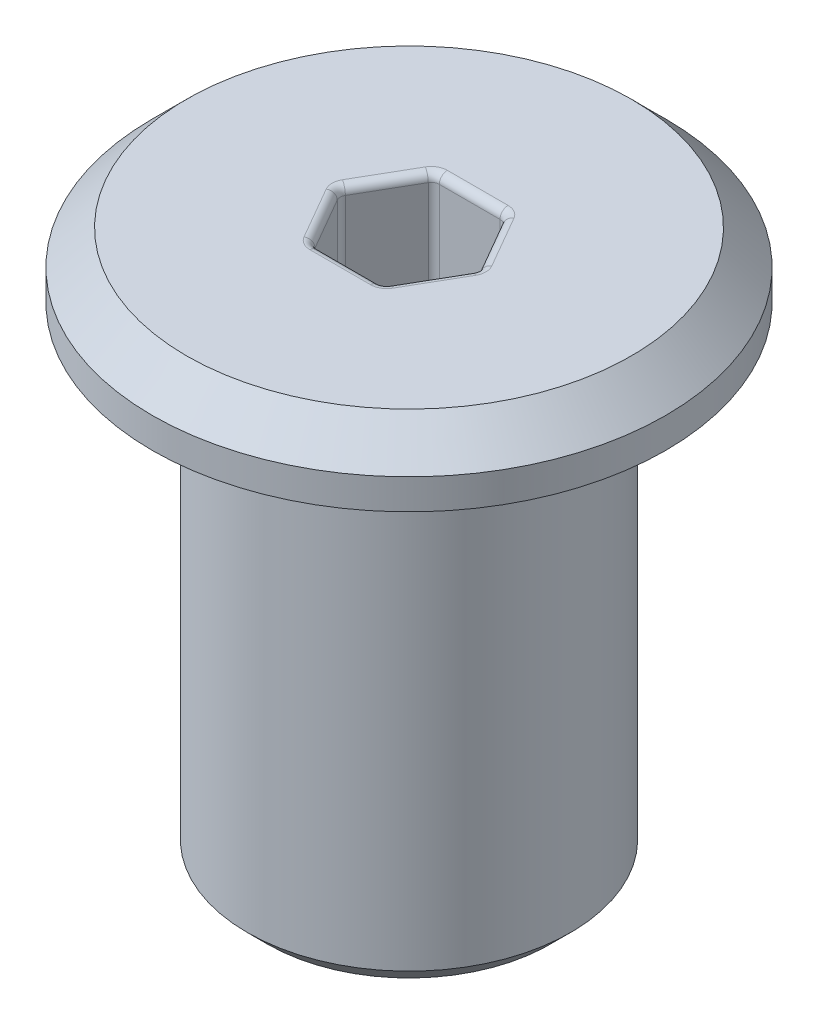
ISO-10303-21;
HEADER;
FILE_DESCRIPTION(('STEP AP214'),'2;1');
FILE_NAME('part.step','',(''),(''),'','','');
FILE_SCHEMA(('AUTOMOTIVE_DESIGN { 1 0 10303 214 1 1 1 1 }'));
ENDSEC;
DATA;
#1=APPLICATION_CONTEXT('core data for automotive mechanical design processes');
#2=APPLICATION_PROTOCOL_DEFINITION('international standard','automotive_design',2000,#1);
#3=PRODUCT_CONTEXT('',#1,'mechanical');
#4=PRODUCT('Part','Part','',(#3));
#5=PRODUCT_RELATED_PRODUCT_CATEGORY('part','',(#4));
#6=PRODUCT_DEFINITION_FORMATION('','',#4);
#7=PRODUCT_DEFINITION_CONTEXT('part definition',#1,'design');
#8=PRODUCT_DEFINITION('design','',#6,#7);
#9=PRODUCT_DEFINITION_SHAPE('','',#8);
#10=(LENGTH_UNIT() NAMED_UNIT(*) SI_UNIT(.MILLI.,.METRE.));
#11=(NAMED_UNIT(*) PLANE_ANGLE_UNIT() SI_UNIT($,.RADIAN.));
#12=(NAMED_UNIT(*) SI_UNIT($,.STERADIAN.) SOLID_ANGLE_UNIT());
#13=UNCERTAINTY_MEASURE_WITH_UNIT(LENGTH_MEASURE(1.E-05),#10,'distance_accuracy_value','');
#14=(GEOMETRIC_REPRESENTATION_CONTEXT(3) GLOBAL_UNCERTAINTY_ASSIGNED_CONTEXT((#13)) GLOBAL_UNIT_ASSIGNED_CONTEXT((#10,
#11,#12)) REPRESENTATION_CONTEXT('',''));
#15=CARTESIAN_POINT('',(0.,0.,0.));
#16=DIRECTION('',(0.,0.,1.));
#17=DIRECTION('',(1.,0.,0.));
#18=AXIS2_PLACEMENT_3D('',#15,#16,#17);
#19=CARTESIAN_POINT('',(0.,4.5,0.));
#20=DIRECTION('',(0.,1.,0.));
#21=DIRECTION('',(0.,0.,1.));
#22=AXIS2_PLACEMENT_3D('',#19,#20,#21);
#23=CYLINDRICAL_SURFACE('',#22,6.35);
#24=CARTESIAN_POINT('',(0.,0.,0.));
#25=DIRECTION('',(0.,1.,0.));
#26=DIRECTION('',(0.,0.,1.));
#27=AXIS2_PLACEMENT_3D('',#24,#25,#26);
#28=CIRCLE('',#27,6.35);
#29=CARTESIAN_POINT('',(0.,0.,6.35));
#30=VERTEX_POINT('',#29);
#31=EDGE_CURVE('E242',#30,#30,#28,.T.);
#32=ORIENTED_EDGE('',*,*,#31,.T.);
#33=EDGE_LOOP('',(#32));
#34=FACE_BOUND('',#33,.T.);
#35=CARTESIAN_POINT('',(0.,0.75,0.));
#36=DIRECTION('',(0.,1.,0.));
#37=DIRECTION('',(0.,0.,1.));
#38=AXIS2_PLACEMENT_3D('',#35,#36,#37);
#39=CIRCLE('',#38,6.35);
#40=CARTESIAN_POINT('',(0.,0.75,6.35));
#41=VERTEX_POINT('',#40);
#42=EDGE_CURVE('E189',#41,#41,#39,.T.);
#43=ORIENTED_EDGE('',*,*,#42,.F.);
#44=EDGE_LOOP('',(#43));
#45=FACE_BOUND('',#44,.T.);
#46=ADVANCED_FACE('F29',(#34,#45),#23,.T.);
#47=CARTESIAN_POINT('',(0.,1.6,0.));
#48=DIRECTION('',(0.,-1.,0.));
#49=DIRECTION('',(0.,0.,-1.));
#50=AXIS2_PLACEMENT_3D('',#47,#48,#49);
#51=CONICAL_SURFACE('',#50,5.5,0.785398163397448);
#52=ORIENTED_EDGE('',*,*,#42,.T.);
#53=EDGE_LOOP('',(#52));
#54=FACE_BOUND('',#53,.T.);
#55=CARTESIAN_POINT('',(0.,1.6,0.));
#56=DIRECTION('',(0.,1.,0.));
#57=DIRECTION('',(0.,0.,1.));
#58=AXIS2_PLACEMENT_3D('',#55,#56,#57);
#59=CIRCLE('',#58,5.5);
#60=CARTESIAN_POINT('',(0.,1.6,5.5));
#61=VERTEX_POINT('',#60);
#62=EDGE_CURVE('E254',#61,#61,#59,.T.);
#63=ORIENTED_EDGE('',*,*,#62,.F.);
#64=EDGE_LOOP('',(#63));
#65=FACE_BOUND('',#64,.T.);
#66=ADVANCED_FACE('F509',(#54,#65),#51,.T.);
#67=CARTESIAN_POINT('',(-5.5,1.6,0.));
#68=DIRECTION('',(0.,1.,0.));
#69=DIRECTION('',(0.,0.,1.));
#70=AXIS2_PLACEMENT_3D('',#67,#68,#69);
#71=PLANE('',#70);
#72=CARTESIAN_POINT('',(0.750555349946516,1.6,-1.3));
#73=DIRECTION('',(0.,1.,0.));
#74=DIRECTION('',(0.,0.,1.));
#75=AXIS2_PLACEMENT_3D('',#72,#73,#74);
#76=CIRCLE('',#75,0.4);
#77=CARTESIAN_POINT('',(1.09696551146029,1.6,-1.5));
#78=VERTEX_POINT('',#77);
#79=CARTESIAN_POINT('',(0.750555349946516,1.6,-1.7));
#80=VERTEX_POINT('',#79);
#81=EDGE_CURVE('E302',#78,#80,#76,.T.);
#82=ORIENTED_EDGE('',*,*,#81,.F.);
#83=DIRECTION('',(-0.499999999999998,0.,-0.86602540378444));
#84=VECTOR('',#83,1.);
#85=CARTESIAN_POINT('',(1.90525588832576,1.6,-0.0999999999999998));
#86=LINE('',#85,#84);
#87=CARTESIAN_POINT('',(1.8475208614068,1.6,-0.199999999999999));
#88=VERTEX_POINT('',#87);
#89=EDGE_CURVE('E313',#78,#88,#86,.F.);
#90=ORIENTED_EDGE('',*,*,#89,.T.);
#91=CARTESIAN_POINT('',(1.50111069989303,1.6,0.));
#92=DIRECTION('',(0.,1.,0.));
#93=DIRECTION('',(0.,0.,1.));
#94=AXIS2_PLACEMENT_3D('',#91,#92,#93);
#95=CIRCLE('',#94,0.4);
#96=CARTESIAN_POINT('',(1.8475208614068,1.6,0.199999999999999));
#97=VERTEX_POINT('',#96);
#98=EDGE_CURVE('E310',#97,#88,#95,.T.);
#99=ORIENTED_EDGE('',*,*,#98,.F.);
#100=DIRECTION('',(0.499999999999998,0.,-0.86602540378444));
#101=VECTOR('',#100,1.);
#102=CARTESIAN_POINT('',(1.03923048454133,1.6,1.6));
#103=LINE('',#102,#101);
#104=CARTESIAN_POINT('',(1.09696551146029,1.6,1.5));
#105=VERTEX_POINT('',#104);
#106=EDGE_CURVE('E308',#97,#105,#103,.F.);
#107=ORIENTED_EDGE('',*,*,#106,.T.);
#108=CARTESIAN_POINT('',(0.750555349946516,1.6,1.3));
#109=DIRECTION('',(0.,1.,0.));
#110=DIRECTION('',(0.,0.,1.));
#111=AXIS2_PLACEMENT_3D('',#108,#109,#110);
#112=CIRCLE('',#111,0.4);
#113=CARTESIAN_POINT('',(0.750555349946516,1.6,1.7));
#114=VERTEX_POINT('',#113);
#115=EDGE_CURVE('E305',#114,#105,#112,.T.);
#116=ORIENTED_EDGE('',*,*,#115,.F.);
#117=DIRECTION('',(1.,0.,0.));
#118=VECTOR('',#117,1.);
#119=CARTESIAN_POINT('',(-0.866025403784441,1.6,1.7));
#120=LINE('',#119,#118);
#121=CARTESIAN_POINT('',(-0.750555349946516,1.6,1.7));
#122=VERTEX_POINT('',#121);
#123=EDGE_CURVE('E300',#114,#122,#120,.F.);
#124=ORIENTED_EDGE('',*,*,#123,.T.);
#125=CARTESIAN_POINT('',(-0.750555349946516,1.6,1.3));
#126=DIRECTION('',(0.,1.,0.));
#127=DIRECTION('',(0.,0.,1.));
#128=AXIS2_PLACEMENT_3D('',#125,#126,#127);
#129=CIRCLE('',#128,0.4);
#130=CARTESIAN_POINT('',(-1.09696551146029,1.6,1.5));
#131=VERTEX_POINT('',#130);
#132=EDGE_CURVE('E297',#131,#122,#129,.T.);
#133=ORIENTED_EDGE('',*,*,#132,.F.);
#134=DIRECTION('',(0.499999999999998,0.,0.86602540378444));
#135=VECTOR('',#134,1.);
#136=CARTESIAN_POINT('',(-1.90525588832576,1.6,0.0999999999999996));
#137=LINE('',#136,#135);
#138=CARTESIAN_POINT('',(-1.8475208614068,1.6,0.199999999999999));
#139=VERTEX_POINT('',#138);
#140=EDGE_CURVE('E292',#131,#139,#137,.F.);
#141=ORIENTED_EDGE('',*,*,#140,.T.);
#142=CARTESIAN_POINT('',(-1.50111069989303,1.6,0.));
#143=DIRECTION('',(0.,1.,0.));
#144=DIRECTION('',(0.,0.,1.));
#145=AXIS2_PLACEMENT_3D('',#142,#143,#144);
#146=CIRCLE('',#145,0.4);
#147=CARTESIAN_POINT('',(-1.8475208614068,1.6,-0.199999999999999));
#148=VERTEX_POINT('',#147);
#149=EDGE_CURVE('E289',#148,#139,#146,.T.);
#150=ORIENTED_EDGE('',*,*,#149,.F.);
#151=DIRECTION('',(-0.499999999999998,0.,0.86602540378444));
#152=VECTOR('',#151,1.);
#153=CARTESIAN_POINT('',(-1.03923048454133,1.6,-1.6));
#154=LINE('',#153,#152);
#155=CARTESIAN_POINT('',(-1.09696551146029,1.6,-1.5));
#156=VERTEX_POINT('',#155);
#157=EDGE_CURVE('E287',#148,#156,#154,.F.);
#158=ORIENTED_EDGE('',*,*,#157,.T.);
#159=CARTESIAN_POINT('',(-0.750555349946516,1.6,-1.3));
#160=DIRECTION('',(0.,1.,0.));
#161=DIRECTION('',(0.,0.,1.));
#162=AXIS2_PLACEMENT_3D('',#159,#160,#161);
#163=CIRCLE('',#162,0.4);
#164=CARTESIAN_POINT('',(-0.750555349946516,1.6,-1.7));
#165=VERTEX_POINT('',#164);
#166=EDGE_CURVE('E284',#165,#156,#163,.T.);
#167=ORIENTED_EDGE('',*,*,#166,.F.);
#168=DIRECTION('',(-1.,0.,0.));
#169=VECTOR('',#168,1.);
#170=CARTESIAN_POINT('',(0.866025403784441,1.6,-1.7));
#171=LINE('',#170,#169);
#172=EDGE_CURVE('E294',#165,#80,#171,.F.);
#173=ORIENTED_EDGE('',*,*,#172,.T.);
#174=EDGE_LOOP('',(#82,#90,#99,#107,#116,#124,#133,#141,#150,#158,#167,#173));
#175=FACE_BOUND('',#174,.T.);
#176=ORIENTED_EDGE('',*,*,#62,.T.);
#177=EDGE_LOOP('',(#176));
#178=FACE_BOUND('',#177,.T.);
#179=ADVANCED_FACE('F468',(#175,#178),#71,.T.);
#180=CARTESIAN_POINT('',(-3.5,-12.,0.));
#181=DIRECTION('',(0.,-1.,0.));
#182=DIRECTION('',(0.,0.,-1.));
#183=AXIS2_PLACEMENT_3D('',#180,#181,#182);
#184=PLANE('',#183);
#185=CARTESIAN_POINT('',(0.,-12.,0.));
#186=DIRECTION('',(0.,1.,0.));
#187=DIRECTION('',(0.,0.,1.));
#188=AXIS2_PLACEMENT_3D('',#185,#186,#187);
#189=CIRCLE('',#188,3.5);
#190=CARTESIAN_POINT('',(0.,-12.,3.5));
#191=VERTEX_POINT('',#190);
#192=EDGE_CURVE('E251',#191,#191,#189,.T.);
#193=ORIENTED_EDGE('',*,*,#192,.F.);
#194=EDGE_LOOP('',(#193));
#195=FACE_BOUND('',#194,.T.);
#196=ADVANCED_FACE('F521',(#195),#184,.T.);
#197=CARTESIAN_POINT('',(0.,-11.5,0.));
#198=DIRECTION('',(0.,1.,0.));
#199=DIRECTION('',(0.,0.,1.));
#200=AXIS2_PLACEMENT_3D('',#197,#198,#199);
#201=CONICAL_SURFACE('',#200,4.,0.785398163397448);
#202=ORIENTED_EDGE('',*,*,#192,.T.);
#203=EDGE_LOOP('',(#202));
#204=FACE_BOUND('',#203,.T.);
#205=CARTESIAN_POINT('',(0.,-11.5,0.));
#206=DIRECTION('',(0.,1.,0.));
#207=DIRECTION('',(0.,0.,1.));
#208=AXIS2_PLACEMENT_3D('',#205,#206,#207);
#209=CIRCLE('',#208,4.);
#210=CARTESIAN_POINT('',(0.,-11.5,4.));
#211=VERTEX_POINT('',#210);
#212=EDGE_CURVE('E248',#211,#211,#209,.T.);
#213=ORIENTED_EDGE('',*,*,#212,.F.);
#214=EDGE_LOOP('',(#213));
#215=FACE_BOUND('',#214,.T.);
#216=ADVANCED_FACE('F526',(#204,#215),#201,.T.);
#217=CARTESIAN_POINT('',(0.,4.5,0.));
#218=DIRECTION('',(0.,1.,0.));
#219=DIRECTION('',(0.,0.,1.));
#220=AXIS2_PLACEMENT_3D('',#217,#218,#219);
#221=CYLINDRICAL_SURFACE('',#220,4.);
#222=ORIENTED_EDGE('',*,*,#212,.T.);
#223=EDGE_LOOP('',(#222));
#224=FACE_BOUND('',#223,.T.);
#225=CARTESIAN_POINT('',(0.,0.,0.));
#226=DIRECTION('',(0.,1.,0.));
#227=DIRECTION('',(0.,0.,1.));
#228=AXIS2_PLACEMENT_3D('',#225,#226,#227);
#229=CIRCLE('',#228,4.);
#230=CARTESIAN_POINT('',(0.,0.,4.));
#231=VERTEX_POINT('',#230);
#232=EDGE_CURVE('E245',#231,#231,#229,.T.);
#233=ORIENTED_EDGE('',*,*,#232,.F.);
#234=EDGE_LOOP('',(#233));
#235=FACE_BOUND('',#234,.T.);
#236=ADVANCED_FACE('F532',(#224,#235),#221,.T.);
#237=CARTESIAN_POINT('',(-6.35,0.,0.));
#238=DIRECTION('',(0.,-1.,0.));
#239=DIRECTION('',(0.,0.,-1.));
#240=AXIS2_PLACEMENT_3D('',#237,#238,#239);
#241=PLANE('',#240);
#242=ORIENTED_EDGE('',*,*,#232,.T.);
#243=EDGE_LOOP('',(#242));
#244=FACE_BOUND('',#243,.T.);
#245=ORIENTED_EDGE('',*,*,#31,.F.);
#246=EDGE_LOOP('',(#245));
#247=FACE_BOUND('',#246,.T.);
#248=ADVANCED_FACE('F536',(#244,#247),#241,.T.);
#249=CARTESIAN_POINT('',(-0.866025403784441,-3.4,-1.5));
#250=DIRECTION('',(-0.86602540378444,0.,-0.499999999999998));
#251=DIRECTION('',(-0.499999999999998,0.,0.86602540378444));
#252=AXIS2_PLACEMENT_3D('',#249,#250,#251);
#253=PLANE('',#252);
#254=DIRECTION('',(0.,1.,0.));
#255=VECTOR('',#254,1.);
#256=CARTESIAN_POINT('',(-1.67431578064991,-3.4,-0.0999999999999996));
#257=LINE('',#256,#255);
#258=CARTESIAN_POINT('',(-1.67431578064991,1.4,-0.0999999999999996));
#259=VERTEX_POINT('',#258);
#260=CARTESIAN_POINT('',(-1.67431578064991,-3.2,-0.0999999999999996));
#261=VERTEX_POINT('',#260);
#262=EDGE_CURVE('E268',#259,#261,#257,.F.);
#263=ORIENTED_EDGE('',*,*,#262,.T.);
#264=DIRECTION('',(-0.499999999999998,0.,0.86602540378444));
#265=VECTOR('',#264,1.);
#266=CARTESIAN_POINT('',(-0.866025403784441,-3.2,-1.5));
#267=LINE('',#266,#265);
#268=CARTESIAN_POINT('',(-0.923760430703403,-3.2,-1.4));
#269=VERTEX_POINT('',#268);
#270=EDGE_CURVE('E272',#261,#269,#267,.F.);
#271=ORIENTED_EDGE('',*,*,#270,.T.);
#272=DIRECTION('',(0.,1.,0.));
#273=VECTOR('',#272,1.);
#274=CARTESIAN_POINT('',(-0.923760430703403,1.6,-1.4));
#275=LINE('',#274,#273);
#276=CARTESIAN_POINT('',(-0.923760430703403,1.4,-1.4));
#277=VERTEX_POINT('',#276);
#278=EDGE_CURVE('E270',#269,#277,#275,.T.);
#279=ORIENTED_EDGE('',*,*,#278,.T.);
#280=DIRECTION('',(-0.499999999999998,0.,0.86602540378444));
#281=VECTOR('',#280,1.);
#282=CARTESIAN_POINT('',(-1.73205080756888,1.4,0.));
#283=LINE('',#282,#281);
#284=EDGE_CURVE('E266',#277,#259,#283,.T.);
#285=ORIENTED_EDGE('',*,*,#284,.T.);
#286=EDGE_LOOP('',(#263,#271,#279,#285));
#287=FACE_BOUND('',#286,.T.);
#288=ADVANCED_FACE('F540',(#287),#253,.F.);
#289=CARTESIAN_POINT('',(-0.866025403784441,-3.4,-1.5));
#290=DIRECTION('',(0.,0.,-1.));
#291=DIRECTION('',(-1.,0.,0.));
#292=AXIS2_PLACEMENT_3D('',#289,#290,#291);
#293=PLANE('',#292);
#294=DIRECTION('',(0.,1.,0.));
#295=VECTOR('',#294,1.);
#296=CARTESIAN_POINT('',(-0.750555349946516,-3.4,-1.5));
#297=LINE('',#296,#295);
#298=CARTESIAN_POINT('',(-0.750555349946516,1.4,-1.5));
#299=VERTEX_POINT('',#298);
#300=CARTESIAN_POINT('',(-0.750555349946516,-3.2,-1.5));
#301=VERTEX_POINT('',#300);
#302=EDGE_CURVE('E279',#299,#301,#297,.F.);
#303=ORIENTED_EDGE('',*,*,#302,.T.);
#304=DIRECTION('',(-1.,0.,0.));
#305=VECTOR('',#304,1.);
#306=CARTESIAN_POINT('',(-0.866025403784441,-3.2,-1.5));
#307=LINE('',#306,#305);
#308=CARTESIAN_POINT('',(0.750555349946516,-3.2,-1.5));
#309=VERTEX_POINT('',#308);
#310=EDGE_CURVE('E281',#301,#309,#307,.F.);
#311=ORIENTED_EDGE('',*,*,#310,.T.);
#312=DIRECTION('',(0.,1.,0.));
#313=VECTOR('',#312,1.);
#314=CARTESIAN_POINT('',(0.750555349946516,1.6,-1.5));
#315=LINE('',#314,#313);
#316=CARTESIAN_POINT('',(0.750555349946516,1.4,-1.5));
#317=VERTEX_POINT('',#316);
#318=EDGE_CURVE('E275',#309,#317,#315,.T.);
#319=ORIENTED_EDGE('',*,*,#318,.T.);
#320=DIRECTION('',(-1.,0.,0.));
#321=VECTOR('',#320,1.);
#322=CARTESIAN_POINT('',(-0.866025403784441,1.4,-1.5));
#323=LINE('',#322,#321);
#324=EDGE_CURVE('E277',#317,#299,#323,.T.);
#325=ORIENTED_EDGE('',*,*,#324,.T.);
#326=EDGE_LOOP('',(#303,#311,#319,#325));
#327=FACE_BOUND('',#326,.T.);
#328=ADVANCED_FACE('F544',(#327),#293,.F.);
#329=CARTESIAN_POINT('',(0.866025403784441,-3.4,-1.5));
#330=DIRECTION('',(0.86602540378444,0.,-0.499999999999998));
#331=DIRECTION('',(-0.499999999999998,0.,-0.86602540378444));
#332=AXIS2_PLACEMENT_3D('',#329,#330,#331);
#333=PLANE('',#332);
#334=DIRECTION('',(0.,1.,0.));
#335=VECTOR('',#334,1.);
#336=CARTESIAN_POINT('',(0.923760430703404,-3.4,-1.4));
#337=LINE('',#336,#335);
#338=CARTESIAN_POINT('',(0.923760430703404,1.4,-1.4));
#339=VERTEX_POINT('',#338);
#340=CARTESIAN_POINT('',(0.923760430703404,-3.2,-1.4));
#341=VERTEX_POINT('',#340);
#342=EDGE_CURVE('E319',#339,#341,#337,.F.);
#343=ORIENTED_EDGE('',*,*,#342,.T.);
#344=DIRECTION('',(-0.499999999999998,0.,-0.86602540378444));
#345=VECTOR('',#344,1.);
#346=CARTESIAN_POINT('',(0.866025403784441,-3.2,-1.5));
#347=LINE('',#346,#345);
#348=CARTESIAN_POINT('',(1.67431578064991,-3.2,-0.0999999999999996));
#349=VERTEX_POINT('',#348);
#350=EDGE_CURVE('E321',#341,#349,#347,.F.);
#351=ORIENTED_EDGE('',*,*,#350,.T.);
#352=DIRECTION('',(0.,1.,0.));
#353=VECTOR('',#352,1.);
#354=CARTESIAN_POINT('',(1.67431578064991,1.6,-0.0999999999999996));
#355=LINE('',#354,#353);
#356=CARTESIAN_POINT('',(1.67431578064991,1.4,-0.0999999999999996));
#357=VERTEX_POINT('',#356);
#358=EDGE_CURVE('E315',#349,#357,#355,.T.);
#359=ORIENTED_EDGE('',*,*,#358,.T.);
#360=DIRECTION('',(-0.499999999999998,0.,-0.86602540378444));
#361=VECTOR('',#360,1.);
#362=CARTESIAN_POINT('',(0.866025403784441,1.4,-1.5));
#363=LINE('',#362,#361);
#364=EDGE_CURVE('E317',#357,#339,#363,.T.);
#365=ORIENTED_EDGE('',*,*,#364,.T.);
#366=EDGE_LOOP('',(#343,#351,#359,#365));
#367=FACE_BOUND('',#366,.T.);
#368=ADVANCED_FACE('F491',(#367),#333,.F.);
#369=CARTESIAN_POINT('',(0.866025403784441,-3.4,1.5));
#370=DIRECTION('',(0.86602540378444,0.,0.499999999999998));
#371=DIRECTION('',(0.499999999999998,0.,-0.86602540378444));
#372=AXIS2_PLACEMENT_3D('',#369,#370,#371);
#373=PLANE('',#372);
#374=DIRECTION('',(0.499999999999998,0.,-0.86602540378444));
#375=VECTOR('',#374,1.);
#376=CARTESIAN_POINT('',(0.866025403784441,-3.2,1.5));
#377=LINE('',#376,#375);
#378=CARTESIAN_POINT('',(1.67431578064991,-3.2,0.0999999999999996));
#379=VERTEX_POINT('',#378);
#380=CARTESIAN_POINT('',(0.923760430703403,-3.2,1.4));
#381=VERTEX_POINT('',#380);
#382=EDGE_CURVE('E36',#379,#381,#377,.F.);
#383=ORIENTED_EDGE('',*,*,#382,.T.);
#384=DIRECTION('',(0.,1.,0.));
#385=VECTOR('',#384,1.);
#386=CARTESIAN_POINT('',(0.923760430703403,1.6,1.4));
#387=LINE('',#386,#385);
#388=CARTESIAN_POINT('',(0.923760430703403,1.4,1.4));
#389=VERTEX_POINT('',#388);
#390=EDGE_CURVE('E11',#381,#389,#387,.T.);
#391=ORIENTED_EDGE('',*,*,#390,.T.);
#392=DIRECTION('',(0.499999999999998,0.,-0.86602540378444));
#393=VECTOR('',#392,1.);
#394=CARTESIAN_POINT('',(1.73205080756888,1.4,0.));
#395=LINE('',#394,#393);
#396=CARTESIAN_POINT('',(1.67431578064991,1.4,0.0999999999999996));
#397=VERTEX_POINT('',#396);
#398=EDGE_CURVE('E341',#389,#397,#395,.T.);
#399=ORIENTED_EDGE('',*,*,#398,.T.);
#400=DIRECTION('',(0.,1.,0.));
#401=VECTOR('',#400,1.);
#402=CARTESIAN_POINT('',(1.67431578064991,-3.4,0.0999999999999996));
#403=LINE('',#402,#401);
#404=EDGE_CURVE('E46',#397,#379,#403,.F.);
#405=ORIENTED_EDGE('',*,*,#404,.T.);
#406=EDGE_LOOP('',(#383,#391,#399,#405));
#407=FACE_BOUND('',#406,.T.);
#408=ADVANCED_FACE('F345',(#407),#373,.F.);
#409=CARTESIAN_POINT('',(-0.866025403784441,-3.4,1.5));
#410=DIRECTION('',(0.,0.,1.));
#411=DIRECTION('',(1.,0.,0.));
#412=AXIS2_PLACEMENT_3D('',#409,#410,#411);
#413=PLANE('',#412);
#414=DIRECTION('',(1.,0.,0.));
#415=VECTOR('',#414,1.);
#416=CARTESIAN_POINT('',(-0.866025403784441,-3.2,1.5));
#417=LINE('',#416,#415);
#418=CARTESIAN_POINT('',(0.750555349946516,-3.2,1.5));
#419=VERTEX_POINT('',#418);
#420=CARTESIAN_POINT('',(-0.750555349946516,-3.2,1.5));
#421=VERTEX_POINT('',#420);
#422=EDGE_CURVE('E200',#419,#421,#417,.F.);
#423=ORIENTED_EDGE('',*,*,#422,.T.);
#424=DIRECTION('',(0.,1.,0.));
#425=VECTOR('',#424,1.);
#426=CARTESIAN_POINT('',(-0.750555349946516,1.6,1.5));
#427=LINE('',#426,#425);
#428=CARTESIAN_POINT('',(-0.750555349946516,1.4,1.5));
#429=VERTEX_POINT('',#428);
#430=EDGE_CURVE('E338',#421,#429,#427,.T.);
#431=ORIENTED_EDGE('',*,*,#430,.T.);
#432=DIRECTION('',(1.,0.,0.));
#433=VECTOR('',#432,1.);
#434=CARTESIAN_POINT('',(0.866025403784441,1.4,1.5));
#435=LINE('',#434,#433);
#436=CARTESIAN_POINT('',(0.750555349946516,1.4,1.5));
#437=VERTEX_POINT('',#436);
#438=EDGE_CURVE('E335',#429,#437,#435,.T.);
#439=ORIENTED_EDGE('',*,*,#438,.T.);
#440=DIRECTION('',(0.,1.,0.));
#441=VECTOR('',#440,1.);
#442=CARTESIAN_POINT('',(0.750555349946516,-3.4,1.5));
#443=LINE('',#442,#441);
#444=EDGE_CURVE('E333',#437,#419,#443,.F.);
#445=ORIENTED_EDGE('',*,*,#444,.T.);
#446=EDGE_LOOP('',(#423,#431,#439,#445));
#447=FACE_BOUND('',#446,.T.);
#448=ADVANCED_FACE('F548',(#447),#413,.F.);
#449=CARTESIAN_POINT('',(-0.866025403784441,-3.4,1.5));
#450=DIRECTION('',(-0.86602540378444,0.,0.499999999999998));
#451=DIRECTION('',(0.499999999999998,0.,0.86602540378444));
#452=AXIS2_PLACEMENT_3D('',#449,#450,#451);
#453=PLANE('',#452);
#454=DIRECTION('',(0.499999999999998,0.,0.86602540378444));
#455=VECTOR('',#454,1.);
#456=CARTESIAN_POINT('',(-0.866025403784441,-3.2,1.5));
#457=LINE('',#456,#455);
#458=CARTESIAN_POINT('',(-0.923760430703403,-3.2,1.4));
#459=VERTEX_POINT('',#458);
#460=CARTESIAN_POINT('',(-1.67431578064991,-3.2,0.0999999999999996));
#461=VERTEX_POINT('',#460);
#462=EDGE_CURVE('E328',#459,#461,#457,.F.);
#463=ORIENTED_EDGE('',*,*,#462,.T.);
#464=DIRECTION('',(0.,1.,0.));
#465=VECTOR('',#464,1.);
#466=CARTESIAN_POINT('',(-1.67431578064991,1.6,0.0999999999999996));
#467=LINE('',#466,#465);
#468=CARTESIAN_POINT('',(-1.67431578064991,1.4,0.0999999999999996));
#469=VERTEX_POINT('',#468);
#470=EDGE_CURVE('E330',#461,#469,#467,.T.);
#471=ORIENTED_EDGE('',*,*,#470,.T.);
#472=DIRECTION('',(0.499999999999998,0.,0.86602540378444));
#473=VECTOR('',#472,1.);
#474=CARTESIAN_POINT('',(-0.866025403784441,1.4,1.5));
#475=LINE('',#474,#473);
#476=CARTESIAN_POINT('',(-0.923760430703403,1.4,1.4));
#477=VERTEX_POINT('',#476);
#478=EDGE_CURVE('E326',#469,#477,#475,.T.);
#479=ORIENTED_EDGE('',*,*,#478,.T.);
#480=DIRECTION('',(0.,1.,0.));
#481=VECTOR('',#480,1.);
#482=CARTESIAN_POINT('',(-0.923760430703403,-3.4,1.4));
#483=LINE('',#482,#481);
#484=EDGE_CURVE('E324',#477,#459,#483,.F.);
#485=ORIENTED_EDGE('',*,*,#484,.T.);
#486=EDGE_LOOP('',(#463,#471,#479,#485));
#487=FACE_BOUND('',#486,.T.);
#488=ADVANCED_FACE('F457',(#487),#453,.F.);
#489=CARTESIAN_POINT('',(-2.59807621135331,-3.4,1.5));
#490=DIRECTION('',(0.,1.,0.));
#491=DIRECTION('',(0.,0.,1.));
#492=AXIS2_PLACEMENT_3D('',#489,#490,#491);
#493=PLANE('',#492);
#494=DIRECTION('',(-1.,0.,0.));
#495=VECTOR('',#494,1.);
#496=CARTESIAN_POINT('',(-2.59807621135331,-3.4,-1.3));
#497=LINE('',#496,#495);
#498=CARTESIAN_POINT('',(0.750555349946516,-3.4,-1.3));
#499=VERTEX_POINT('',#498);
#500=CARTESIAN_POINT('',(-0.750555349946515,-3.4,-1.3));
#501=VERTEX_POINT('',#500);
#502=EDGE_CURVE('E262',#499,#501,#497,.T.);
#503=ORIENTED_EDGE('',*,*,#502,.T.);
#504=DIRECTION('',(-0.499999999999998,0.,0.86602540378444));
#505=VECTOR('',#504,1.);
#506=CARTESIAN_POINT('',(-2.42487113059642,-3.4,1.6));
#507=LINE('',#506,#505);
#508=CARTESIAN_POINT('',(-1.50111069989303,-3.4,0.));
#509=VERTEX_POINT('',#508);
#510=EDGE_CURVE('E264',#501,#509,#507,.T.);
#511=ORIENTED_EDGE('',*,*,#510,.T.);
#512=DIRECTION('',(0.499999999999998,0.,0.86602540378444));
#513=VECTOR('',#512,1.);
#514=CARTESIAN_POINT('',(-1.12583302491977,-3.4,0.650000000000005));
#515=LINE('',#514,#513);
#516=CARTESIAN_POINT('',(-0.750555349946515,-3.4,1.3));
#517=VERTEX_POINT('',#516);
#518=EDGE_CURVE('E174',#509,#517,#515,.T.);
#519=ORIENTED_EDGE('',*,*,#518,.T.);
#520=DIRECTION('',(1.,0.,0.));
#521=VECTOR('',#520,1.);
#522=CARTESIAN_POINT('',(-2.59807621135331,-3.4,1.3));
#523=LINE('',#522,#521);
#524=CARTESIAN_POINT('',(0.750555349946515,-3.4,1.3));
#525=VERTEX_POINT('',#524);
#526=EDGE_CURVE('E167',#517,#525,#523,.T.);
#527=ORIENTED_EDGE('',*,*,#526,.T.);
#528=DIRECTION('',(0.499999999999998,0.,-0.86602540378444));
#529=VECTOR('',#528,1.);
#530=CARTESIAN_POINT('',(-0.17320508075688,-3.4,2.9));
#531=LINE('',#530,#529);
#532=CARTESIAN_POINT('',(1.50111069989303,-3.4,0.));
#533=VERTEX_POINT('',#532);
#534=EDGE_CURVE('E170',#525,#533,#531,.T.);
#535=ORIENTED_EDGE('',*,*,#534,.T.);
#536=DIRECTION('',(-0.499999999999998,0.,-0.86602540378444));
#537=VECTOR('',#536,1.);
#538=CARTESIAN_POINT('',(1.12583302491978,-3.4,-0.649999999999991));
#539=LINE('',#538,#537);
#540=EDGE_CURVE('E260',#533,#499,#539,.T.);
#541=ORIENTED_EDGE('',*,*,#540,.T.);
#542=EDGE_LOOP('',(#503,#511,#519,#527,#535,#541));
#543=FACE_BOUND('',#542,.T.);
#544=ADVANCED_FACE('F169',(#543),#493,.T.);
#545=CARTESIAN_POINT('',(1.03923048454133,1.4,1.6));
#546=DIRECTION('',(-0.499999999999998,0.,0.86602540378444));
#547=DIRECTION('',(0.86602540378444,0.,0.499999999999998));
#548=AXIS2_PLACEMENT_3D('',#545,#546,#547);
#549=CYLINDRICAL_SURFACE('',#548,0.2);
#550=CARTESIAN_POINT('',(1.09696551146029,1.4,1.5));
#551=DIRECTION('',(-0.499999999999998,0.,0.86602540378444));
#552=DIRECTION('',(0.86602540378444,0.,0.499999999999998));
#553=AXIS2_PLACEMENT_3D('',#550,#551,#552);
#554=CIRCLE('',#553,0.2);
#555=EDGE_CURVE('E236',#105,#389,#554,.T.);
#556=ORIENTED_EDGE('',*,*,#555,.F.);
#557=ORIENTED_EDGE('',*,*,#106,.F.);
#558=CARTESIAN_POINT('',(1.8475208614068,1.4,0.199999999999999));
#559=DIRECTION('',(0.499999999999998,0.,-0.86602540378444));
#560=DIRECTION('',(-0.86602540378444,0.,-0.499999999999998));
#561=AXIS2_PLACEMENT_3D('',#558,#559,#560);
#562=CIRCLE('',#561,0.2);
#563=EDGE_CURVE('E239',#397,#97,#562,.T.);
#564=ORIENTED_EDGE('',*,*,#563,.F.);
#565=ORIENTED_EDGE('',*,*,#398,.F.);
#566=EDGE_LOOP('',(#556,#557,#564,#565));
#567=FACE_BOUND('',#566,.T.);
#568=ADVANCED_FACE('F350',(#567),#549,.T.);
#569=CARTESIAN_POINT('',(1.50111069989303,1.4,0.));
#570=DIRECTION('',(0.,1.,0.));
#571=DIRECTION('',(0.,0.,1.));
#572=AXIS2_PLACEMENT_3D('',#569,#570,#571);
#573=TOROIDAL_SURFACE('',#572,0.4,0.2);
#574=ORIENTED_EDGE('',*,*,#563,.T.);
#575=ORIENTED_EDGE('',*,*,#98,.T.);
#576=CARTESIAN_POINT('',(1.8475208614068,1.4,-0.199999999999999));
#577=DIRECTION('',(0.499999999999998,0.,0.86602540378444));
#578=DIRECTION('',(0.86602540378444,0.,-0.499999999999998));
#579=AXIS2_PLACEMENT_3D('',#576,#577,#578);
#580=CIRCLE('',#579,0.2);
#581=EDGE_CURVE('E233',#357,#88,#580,.F.);
#582=ORIENTED_EDGE('',*,*,#581,.F.);
#583=CARTESIAN_POINT('',(1.50111069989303,1.4,0.));
#584=DIRECTION('',(0.,1.,0.));
#585=DIRECTION('',(0.,0.,1.));
#586=AXIS2_PLACEMENT_3D('',#583,#584,#585);
#587=CIRCLE('',#586,0.2);
#588=EDGE_CURVE('E230',#397,#357,#587,.T.);
#589=ORIENTED_EDGE('',*,*,#588,.F.);
#590=EDGE_LOOP('',(#574,#575,#582,#589));
#591=FACE_BOUND('',#590,.T.);
#592=ADVANCED_FACE('F353',(#591),#573,.T.);
#593=CARTESIAN_POINT('',(0.750555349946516,1.4,1.3));
#594=DIRECTION('',(0.,1.,0.));
#595=DIRECTION('',(0.,0.,1.));
#596=AXIS2_PLACEMENT_3D('',#593,#594,#595);
#597=TOROIDAL_SURFACE('',#596,0.4,0.2);
#598=ORIENTED_EDGE('',*,*,#115,.T.);
#599=ORIENTED_EDGE('',*,*,#555,.T.);
#600=CARTESIAN_POINT('',(0.750555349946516,1.4,1.3));
#601=DIRECTION('',(0.,1.,0.));
#602=DIRECTION('',(0.,0.,1.));
#603=AXIS2_PLACEMENT_3D('',#600,#601,#602);
#604=CIRCLE('',#603,0.2);
#605=EDGE_CURVE('E228',#437,#389,#604,.T.);
#606=ORIENTED_EDGE('',*,*,#605,.F.);
#607=CARTESIAN_POINT('',(0.750555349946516,1.4,1.7));
#608=DIRECTION('',(1.,0.,0.));
#609=DIRECTION('',(0.,0.,-1.));
#610=AXIS2_PLACEMENT_3D('',#607,#608,#609);
#611=CIRCLE('',#610,0.2);
#612=EDGE_CURVE('E225',#114,#437,#611,.F.);
#613=ORIENTED_EDGE('',*,*,#612,.F.);
#614=EDGE_LOOP('',(#598,#599,#606,#613));
#615=FACE_BOUND('',#614,.T.);
#616=ADVANCED_FACE('F565',(#615),#597,.T.);
#617=CARTESIAN_POINT('',(1.03923048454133,1.4,-1.6));
#618=DIRECTION('',(0.499999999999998,0.,0.86602540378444));
#619=DIRECTION('',(0.86602540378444,0.,-0.499999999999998));
#620=AXIS2_PLACEMENT_3D('',#617,#618,#619);
#621=CYLINDRICAL_SURFACE('',#620,0.2);
#622=ORIENTED_EDGE('',*,*,#581,.T.);
#623=ORIENTED_EDGE('',*,*,#89,.F.);
#624=CARTESIAN_POINT('',(1.09696551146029,1.4,-1.5));
#625=DIRECTION('',(-0.499999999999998,0.,-0.86602540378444));
#626=DIRECTION('',(-0.86602540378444,0.,0.499999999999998));
#627=AXIS2_PLACEMENT_3D('',#624,#625,#626);
#628=CIRCLE('',#627,0.2);
#629=EDGE_CURVE('E222',#339,#78,#628,.T.);
#630=ORIENTED_EDGE('',*,*,#629,.F.);
#631=ORIENTED_EDGE('',*,*,#364,.F.);
#632=EDGE_LOOP('',(#622,#623,#630,#631));
#633=FACE_BOUND('',#632,.T.);
#634=ADVANCED_FACE('F489',(#633),#621,.T.);
#635=CARTESIAN_POINT('',(1.50111069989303,-3.4,0.));
#636=DIRECTION('',(0.,-1.,0.));
#637=DIRECTION('',(0.,0.,-1.));
#638=AXIS2_PLACEMENT_3D('',#635,#636,#637);
#639=CYLINDRICAL_SURFACE('',#638,0.2);
#640=ORIENTED_EDGE('',*,*,#588,.T.);
#641=ORIENTED_EDGE('',*,*,#358,.F.);
#642=CARTESIAN_POINT('',(1.50111069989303,-3.2,0.));
#643=DIRECTION('',(0.,1.,0.));
#644=DIRECTION('',(0.,0.,1.));
#645=AXIS2_PLACEMENT_3D('',#642,#643,#644);
#646=CIRCLE('',#645,0.2);
#647=EDGE_CURVE('E219',#379,#349,#646,.T.);
#648=ORIENTED_EDGE('',*,*,#647,.F.);
#649=ORIENTED_EDGE('',*,*,#404,.F.);
#650=EDGE_LOOP('',(#640,#641,#648,#649));
#651=FACE_BOUND('',#650,.T.);
#652=ADVANCED_FACE('F358',(#651),#639,.F.);
#653=CARTESIAN_POINT('',(-0.17320508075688,-3.2,2.9));
#654=DIRECTION('',(0.499999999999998,0.,-0.86602540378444));
#655=DIRECTION('',(-0.86602540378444,0.,-0.499999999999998));
#656=AXIS2_PLACEMENT_3D('',#653,#654,#655);
#657=CYLINDRICAL_SURFACE('',#656,0.2);
#658=CARTESIAN_POINT('',(0.750555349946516,-3.2,1.3));
#659=DIRECTION('',(0.499999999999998,0.,-0.86602540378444));
#660=DIRECTION('',(-0.86602540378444,0.,-0.499999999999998));
#661=AXIS2_PLACEMENT_3D('',#658,#659,#660);
#662=CIRCLE('',#661,0.2);
#663=EDGE_CURVE('E184',#381,#525,#662,.T.);
#664=ORIENTED_EDGE('',*,*,#663,.F.);
#665=ORIENTED_EDGE('',*,*,#382,.F.);
#666=CARTESIAN_POINT('',(1.50111069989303,-3.2,0.));
#667=DIRECTION('',(-0.500000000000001,0.,0.866025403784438));
#668=DIRECTION('',(0.866025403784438,0.,0.500000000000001));
#669=AXIS2_PLACEMENT_3D('',#666,#667,#668);
#670=CIRCLE('',#669,0.2);
#671=EDGE_CURVE('E187',#533,#379,#670,.T.);
#672=ORIENTED_EDGE('',*,*,#671,.F.);
#673=ORIENTED_EDGE('',*,*,#534,.F.);
#674=EDGE_LOOP('',(#664,#665,#672,#673));
#675=FACE_BOUND('',#674,.T.);
#676=ADVANCED_FACE('F183',(#675),#657,.F.);
#677=CARTESIAN_POINT('',(0.750555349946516,-3.4,1.3));
#678=DIRECTION('',(0.,-1.,0.));
#679=DIRECTION('',(0.,0.,-1.));
#680=AXIS2_PLACEMENT_3D('',#677,#678,#679);
#681=CYLINDRICAL_SURFACE('',#680,0.2);
#682=ORIENTED_EDGE('',*,*,#605,.T.);
#683=ORIENTED_EDGE('',*,*,#390,.F.);
#684=CARTESIAN_POINT('',(0.750555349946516,-3.2,1.3));
#685=DIRECTION('',(0.,1.,0.));
#686=DIRECTION('',(0.,0.,1.));
#687=AXIS2_PLACEMENT_3D('',#684,#685,#686);
#688=CIRCLE('',#687,0.2);
#689=EDGE_CURVE('E197',#419,#381,#688,.T.);
#690=ORIENTED_EDGE('',*,*,#689,.F.);
#691=ORIENTED_EDGE('',*,*,#444,.F.);
#692=EDGE_LOOP('',(#682,#683,#690,#691));
#693=FACE_BOUND('',#692,.T.);
#694=ADVANCED_FACE('F575',(#693),#681,.F.);
#695=CARTESIAN_POINT('',(-0.866025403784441,1.4,1.7));
#696=DIRECTION('',(-1.,0.,0.));
#697=DIRECTION('',(0.,0.,1.));
#698=AXIS2_PLACEMENT_3D('',#695,#696,#697);
#699=CYLINDRICAL_SURFACE('',#698,0.2);
#700=ORIENTED_EDGE('',*,*,#612,.T.);
#701=ORIENTED_EDGE('',*,*,#438,.F.);
#702=CARTESIAN_POINT('',(-0.750555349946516,1.4,1.7));
#703=DIRECTION('',(-1.,0.,0.));
#704=DIRECTION('',(0.,0.,1.));
#705=AXIS2_PLACEMENT_3D('',#702,#703,#704);
#706=CIRCLE('',#705,0.2);
#707=EDGE_CURVE('E214',#122,#429,#706,.T.);
#708=ORIENTED_EDGE('',*,*,#707,.F.);
#709=ORIENTED_EDGE('',*,*,#123,.F.);
#710=EDGE_LOOP('',(#700,#701,#708,#709));
#711=FACE_BOUND('',#710,.T.);
#712=ADVANCED_FACE('F578',(#711),#699,.T.);
#713=CARTESIAN_POINT('',(0.750555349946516,1.4,-1.3));
#714=DIRECTION('',(0.,1.,0.));
#715=DIRECTION('',(0.,0.,1.));
#716=AXIS2_PLACEMENT_3D('',#713,#714,#715);
#717=TOROIDAL_SURFACE('',#716,0.4,0.2);
#718=ORIENTED_EDGE('',*,*,#629,.T.);
#719=ORIENTED_EDGE('',*,*,#81,.T.);
#720=CARTESIAN_POINT('',(0.750555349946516,1.4,-1.7));
#721=DIRECTION('',(1.,0.,0.));
#722=DIRECTION('',(0.,0.,-1.));
#723=AXIS2_PLACEMENT_3D('',#720,#721,#722);
#724=CIRCLE('',#723,0.2);
#725=EDGE_CURVE('E212',#317,#80,#724,.F.);
#726=ORIENTED_EDGE('',*,*,#725,.F.);
#727=CARTESIAN_POINT('',(0.750555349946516,1.4,-1.3));
#728=DIRECTION('',(0.,1.,0.));
#729=DIRECTION('',(0.,0.,1.));
#730=AXIS2_PLACEMENT_3D('',#727,#728,#729);
#731=CIRCLE('',#730,0.2);
#732=EDGE_CURVE('E204',#339,#317,#731,.T.);
#733=ORIENTED_EDGE('',*,*,#732,.F.);
#734=EDGE_LOOP('',(#718,#719,#726,#733));
#735=FACE_BOUND('',#734,.T.);
#736=ADVANCED_FACE('F485',(#735),#717,.T.);
#737=CARTESIAN_POINT('',(1.50111069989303,-3.2,0.));
#738=DIRECTION('',(0.,0.,1.));
#739=DIRECTION('',(1.,0.,0.));
#740=AXIS2_PLACEMENT_3D('',#737,#738,#739);
#741=SPHERICAL_SURFACE('',#740,0.2);
#742=ORIENTED_EDGE('',*,*,#671,.T.);
#743=ORIENTED_EDGE('',*,*,#647,.T.);
#744=CARTESIAN_POINT('',(1.50111069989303,-3.2,0.));
#745=DIRECTION('',(-0.499999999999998,0.,-0.86602540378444));
#746=DIRECTION('',(-0.86602540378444,0.,0.499999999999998));
#747=AXIS2_PLACEMENT_3D('',#744,#745,#746);
#748=CIRCLE('',#747,0.2);
#749=EDGE_CURVE('E201',#533,#349,#748,.F.);
#750=ORIENTED_EDGE('',*,*,#749,.F.);
#751=EDGE_LOOP('',(#742,#743,#750));
#752=FACE_BOUND('',#751,.T.);
#753=ADVANCED_FACE('F360',(#752),#741,.F.);
#754=CARTESIAN_POINT('',(0.750555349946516,-3.2,1.3));
#755=DIRECTION('',(0.,0.,1.));
#756=DIRECTION('',(1.,0.,0.));
#757=AXIS2_PLACEMENT_3D('',#754,#755,#756);
#758=SPHERICAL_SURFACE('',#757,0.2);
#759=ORIENTED_EDGE('',*,*,#689,.T.);
#760=ORIENTED_EDGE('',*,*,#663,.T.);
#761=CARTESIAN_POINT('',(0.750555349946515,-3.2,1.3));
#762=DIRECTION('',(-1.,0.,0.));
#763=DIRECTION('',(0.,0.,1.));
#764=AXIS2_PLACEMENT_3D('',#761,#762,#763);
#765=CIRCLE('',#764,0.2);
#766=EDGE_CURVE('E194',#419,#525,#765,.F.);
#767=ORIENTED_EDGE('',*,*,#766,.F.);
#768=EDGE_LOOP('',(#759,#760,#767));
#769=FACE_BOUND('',#768,.T.);
#770=ADVANCED_FACE('F193',(#769),#758,.F.);
#771=CARTESIAN_POINT('',(-0.750555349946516,1.4,1.3));
#772=DIRECTION('',(0.,1.,0.));
#773=DIRECTION('',(0.,0.,1.));
#774=AXIS2_PLACEMENT_3D('',#771,#772,#773);
#775=TOROIDAL_SURFACE('',#774,0.4,0.2);
#776=ORIENTED_EDGE('',*,*,#132,.T.);
#777=ORIENTED_EDGE('',*,*,#707,.T.);
#778=CARTESIAN_POINT('',(-0.750555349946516,1.4,1.3));
#779=DIRECTION('',(0.,1.,0.));
#780=DIRECTION('',(0.,0.,1.));
#781=AXIS2_PLACEMENT_3D('',#778,#779,#780);
#782=CIRCLE('',#781,0.2);
#783=EDGE_CURVE('E202',#477,#429,#782,.T.);
#784=ORIENTED_EDGE('',*,*,#783,.F.);
#785=CARTESIAN_POINT('',(-1.09696551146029,1.4,1.5));
#786=DIRECTION('',(0.499999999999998,0.,0.86602540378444));
#787=DIRECTION('',(0.86602540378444,0.,-0.499999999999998));
#788=AXIS2_PLACEMENT_3D('',#785,#786,#787);
#789=CIRCLE('',#788,0.2);
#790=EDGE_CURVE('E206',#131,#477,#789,.F.);
#791=ORIENTED_EDGE('',*,*,#790,.F.);
#792=EDGE_LOOP('',(#776,#777,#784,#791));
#793=FACE_BOUND('',#792,.T.);
#794=ADVANCED_FACE('F449',(#793),#775,.T.);
#795=CARTESIAN_POINT('',(-0.866025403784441,1.4,-1.7));
#796=DIRECTION('',(1.,0.,0.));
#797=DIRECTION('',(0.,0.,-1.));
#798=AXIS2_PLACEMENT_3D('',#795,#796,#797);
#799=CYLINDRICAL_SURFACE('',#798,0.2);
#800=ORIENTED_EDGE('',*,*,#725,.T.);
#801=ORIENTED_EDGE('',*,*,#172,.F.);
#802=CARTESIAN_POINT('',(-0.750555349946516,1.4,-1.7));
#803=DIRECTION('',(-1.,0.,0.));
#804=DIRECTION('',(0.,0.,1.));
#805=AXIS2_PLACEMENT_3D('',#802,#803,#804);
#806=CIRCLE('',#805,0.2);
#807=EDGE_CURVE('E434',#299,#165,#806,.T.);
#808=ORIENTED_EDGE('',*,*,#807,.F.);
#809=ORIENTED_EDGE('',*,*,#324,.F.);
#810=EDGE_LOOP('',(#800,#801,#808,#809));
#811=FACE_BOUND('',#810,.T.);
#812=ADVANCED_FACE('F480',(#811),#799,.T.);
#813=CARTESIAN_POINT('',(0.750555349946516,-3.4,-1.3));
#814=DIRECTION('',(0.,-1.,0.));
#815=DIRECTION('',(0.,0.,-1.));
#816=AXIS2_PLACEMENT_3D('',#813,#814,#815);
#817=CYLINDRICAL_SURFACE('',#816,0.2);
#818=ORIENTED_EDGE('',*,*,#732,.T.);
#819=ORIENTED_EDGE('',*,*,#318,.F.);
#820=CARTESIAN_POINT('',(0.750555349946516,-3.2,-1.3));
#821=DIRECTION('',(0.,1.,0.));
#822=DIRECTION('',(0.,0.,1.));
#823=AXIS2_PLACEMENT_3D('',#820,#821,#822);
#824=CIRCLE('',#823,0.2);
#825=EDGE_CURVE('E431',#341,#309,#824,.T.);
#826=ORIENTED_EDGE('',*,*,#825,.F.);
#827=ORIENTED_EDGE('',*,*,#342,.F.);
#828=EDGE_LOOP('',(#818,#819,#826,#827));
#829=FACE_BOUND('',#828,.T.);
#830=ADVANCED_FACE('F496',(#829),#817,.F.);
#831=CARTESIAN_POINT('',(1.12583302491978,-3.2,-0.649999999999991));
#832=DIRECTION('',(-0.499999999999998,0.,-0.86602540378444));
#833=DIRECTION('',(-0.86602540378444,0.,0.499999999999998));
#834=AXIS2_PLACEMENT_3D('',#831,#832,#833);
#835=CYLINDRICAL_SURFACE('',#834,0.2);
#836=ORIENTED_EDGE('',*,*,#749,.T.);
#837=ORIENTED_EDGE('',*,*,#350,.F.);
#838=CARTESIAN_POINT('',(0.750555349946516,-3.2,-1.3));
#839=DIRECTION('',(0.499999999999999,0.,0.866025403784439));
#840=DIRECTION('',(0.866025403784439,0.,-0.499999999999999));
#841=AXIS2_PLACEMENT_3D('',#838,#839,#840);
#842=CIRCLE('',#841,0.2);
#843=EDGE_CURVE('E367',#499,#341,#842,.T.);
#844=ORIENTED_EDGE('',*,*,#843,.F.);
#845=ORIENTED_EDGE('',*,*,#540,.F.);
#846=EDGE_LOOP('',(#836,#837,#844,#845));
#847=FACE_BOUND('',#846,.T.);
#848=ADVANCED_FACE('F365',(#847),#835,.F.);
#849=CARTESIAN_POINT('',(-2.59807621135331,-3.2,1.3));
#850=DIRECTION('',(1.,0.,0.));
#851=DIRECTION('',(0.,0.,-1.));
#852=AXIS2_PLACEMENT_3D('',#849,#850,#851);
#853=CYLINDRICAL_SURFACE('',#852,0.2);
#854=ORIENTED_EDGE('',*,*,#766,.T.);
#855=ORIENTED_EDGE('',*,*,#526,.F.);
#856=CARTESIAN_POINT('',(-0.750555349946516,-3.2,1.3));
#857=DIRECTION('',(1.,0.,0.));
#858=DIRECTION('',(0.,1.,0.));
#859=AXIS2_PLACEMENT_3D('',#856,#857,#858);
#860=CIRCLE('',#859,0.2);
#861=EDGE_CURVE('E428',#421,#517,#860,.T.);
#862=ORIENTED_EDGE('',*,*,#861,.F.);
#863=ORIENTED_EDGE('',*,*,#422,.F.);
#864=EDGE_LOOP('',(#854,#855,#862,#863));
#865=FACE_BOUND('',#864,.T.);
#866=ADVANCED_FACE('F199',(#865),#853,.F.);
#867=CARTESIAN_POINT('',(-0.750555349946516,-3.4,1.3));
#868=DIRECTION('',(0.,-1.,0.));
#869=DIRECTION('',(0.,0.,-1.));
#870=AXIS2_PLACEMENT_3D('',#867,#868,#869);
#871=CYLINDRICAL_SURFACE('',#870,0.2);
#872=ORIENTED_EDGE('',*,*,#783,.T.);
#873=ORIENTED_EDGE('',*,*,#430,.F.);
#874=CARTESIAN_POINT('',(-0.750555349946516,-3.2,1.3));
#875=DIRECTION('',(0.,1.,0.));
#876=DIRECTION('',(0.,0.,1.));
#877=AXIS2_PLACEMENT_3D('',#874,#875,#876);
#878=CIRCLE('',#877,0.2);
#879=EDGE_CURVE('E426',#459,#421,#878,.T.);
#880=ORIENTED_EDGE('',*,*,#879,.F.);
#881=ORIENTED_EDGE('',*,*,#484,.F.);
#882=EDGE_LOOP('',(#872,#873,#880,#881));
#883=FACE_BOUND('',#882,.T.);
#884=ADVANCED_FACE('F455',(#883),#871,.F.);
#885=CARTESIAN_POINT('',(-1.03923048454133,1.4,1.6));
#886=DIRECTION('',(-0.499999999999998,0.,-0.86602540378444));
#887=DIRECTION('',(-0.86602540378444,0.,0.499999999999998));
#888=AXIS2_PLACEMENT_3D('',#885,#886,#887);
#889=CYLINDRICAL_SURFACE('',#888,0.2);
#890=ORIENTED_EDGE('',*,*,#790,.T.);
#891=ORIENTED_EDGE('',*,*,#478,.F.);
#892=CARTESIAN_POINT('',(-1.8475208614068,1.4,0.199999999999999));
#893=DIRECTION('',(-0.499999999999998,0.,-0.866025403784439));
#894=DIRECTION('',(-0.86602540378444,0.,0.499999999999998));
#895=AXIS2_PLACEMENT_3D('',#892,#893,#894);
#896=CIRCLE('',#895,0.2);
#897=EDGE_CURVE('E423',#139,#469,#896,.T.);
#898=ORIENTED_EDGE('',*,*,#897,.F.);
#899=ORIENTED_EDGE('',*,*,#140,.F.);
#900=EDGE_LOOP('',(#890,#891,#898,#899));
#901=FACE_BOUND('',#900,.T.);
#902=ADVANCED_FACE('F445',(#901),#889,.T.);
#903=CARTESIAN_POINT('',(-1.03923048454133,1.4,-1.6));
#904=DIRECTION('',(0.499999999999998,0.,-0.86602540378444));
#905=DIRECTION('',(-0.86602540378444,0.,-0.499999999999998));
#906=AXIS2_PLACEMENT_3D('',#903,#904,#905);
#907=CYLINDRICAL_SURFACE('',#906,0.2);
#908=CARTESIAN_POINT('',(-1.09696551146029,1.4,-1.5));
#909=DIRECTION('',(0.499999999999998,0.,-0.86602540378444));
#910=DIRECTION('',(-0.86602540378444,0.,-0.499999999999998));
#911=AXIS2_PLACEMENT_3D('',#908,#909,#910);
#912=CIRCLE('',#911,0.2);
#913=EDGE_CURVE('E437',#156,#277,#912,.T.);
#914=ORIENTED_EDGE('',*,*,#913,.F.);
#915=ORIENTED_EDGE('',*,*,#157,.F.);
#916=CARTESIAN_POINT('',(-1.8475208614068,1.4,-0.199999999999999));
#917=DIRECTION('',(-0.499999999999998,0.,0.86602540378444));
#918=DIRECTION('',(0.86602540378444,0.,0.499999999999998));
#919=AXIS2_PLACEMENT_3D('',#916,#917,#918);
#920=CIRCLE('',#919,0.2);
#921=EDGE_CURVE('E420',#259,#148,#920,.T.);
#922=ORIENTED_EDGE('',*,*,#921,.F.);
#923=ORIENTED_EDGE('',*,*,#284,.F.);
#924=EDGE_LOOP('',(#914,#915,#922,#923));
#925=FACE_BOUND('',#924,.T.);
#926=ADVANCED_FACE('F472',(#925),#907,.T.);
#927=CARTESIAN_POINT('',(-0.750555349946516,1.4,-1.3));
#928=DIRECTION('',(0.,1.,0.));
#929=DIRECTION('',(0.,0.,1.));
#930=AXIS2_PLACEMENT_3D('',#927,#928,#929);
#931=TOROIDAL_SURFACE('',#930,0.4,0.2);
#932=ORIENTED_EDGE('',*,*,#166,.T.);
#933=ORIENTED_EDGE('',*,*,#913,.T.);
#934=CARTESIAN_POINT('',(-0.750555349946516,1.4,-1.3));
#935=DIRECTION('',(0.,1.,0.));
#936=DIRECTION('',(0.,0.,1.));
#937=AXIS2_PLACEMENT_3D('',#934,#935,#936);
#938=CIRCLE('',#937,0.2);
#939=EDGE_CURVE('E413',#299,#277,#938,.T.);
#940=ORIENTED_EDGE('',*,*,#939,.F.);
#941=ORIENTED_EDGE('',*,*,#807,.T.);
#942=EDGE_LOOP('',(#932,#933,#940,#941));
#943=FACE_BOUND('',#942,.T.);
#944=ADVANCED_FACE('F476',(#943),#931,.T.);
#945=CARTESIAN_POINT('',(0.750555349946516,-3.2,-1.3));
#946=DIRECTION('',(0.,0.,1.));
#947=DIRECTION('',(1.,0.,0.));
#948=AXIS2_PLACEMENT_3D('',#945,#946,#947);
#949=SPHERICAL_SURFACE('',#948,0.2);
#950=ORIENTED_EDGE('',*,*,#843,.T.);
#951=ORIENTED_EDGE('',*,*,#825,.T.);
#952=CARTESIAN_POINT('',(0.750555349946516,-3.2,-1.3));
#953=DIRECTION('',(-1.,0.,0.));
#954=DIRECTION('',(0.,-1.,0.));
#955=AXIS2_PLACEMENT_3D('',#952,#953,#954);
#956=CIRCLE('',#955,0.2);
#957=EDGE_CURVE('E410',#499,#309,#956,.F.);
#958=ORIENTED_EDGE('',*,*,#957,.F.);
#959=EDGE_LOOP('',(#950,#951,#958));
#960=FACE_BOUND('',#959,.T.);
#961=ADVANCED_FACE('F498',(#960),#949,.F.);
#962=CARTESIAN_POINT('',(-0.750555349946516,-3.2,1.3));
#963=DIRECTION('',(0.,0.,1.));
#964=DIRECTION('',(1.,0.,0.));
#965=AXIS2_PLACEMENT_3D('',#962,#963,#964);
#966=SPHERICAL_SURFACE('',#965,0.2);
#967=ORIENTED_EDGE('',*,*,#879,.T.);
#968=ORIENTED_EDGE('',*,*,#861,.T.);
#969=CARTESIAN_POINT('',(-0.750555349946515,-3.2,1.3));
#970=DIRECTION('',(-0.499999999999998,0.,-0.86602540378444));
#971=DIRECTION('',(-0.86602540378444,0.,0.499999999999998));
#972=AXIS2_PLACEMENT_3D('',#969,#970,#971);
#973=CIRCLE('',#972,0.2);
#974=EDGE_CURVE('E407',#459,#517,#973,.F.);
#975=ORIENTED_EDGE('',*,*,#974,.F.);
#976=EDGE_LOOP('',(#967,#968,#975));
#977=FACE_BOUND('',#976,.T.);
#978=ADVANCED_FACE('F500',(#977),#966,.F.);
#979=CARTESIAN_POINT('',(-1.50111069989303,1.4,0.));
#980=DIRECTION('',(0.,1.,0.));
#981=DIRECTION('',(0.,0.,1.));
#982=AXIS2_PLACEMENT_3D('',#979,#980,#981);
#983=TOROIDAL_SURFACE('',#982,0.4,0.2);
#984=ORIENTED_EDGE('',*,*,#149,.T.);
#985=ORIENTED_EDGE('',*,*,#897,.T.);
#986=CARTESIAN_POINT('',(-1.50111069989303,1.4,0.));
#987=DIRECTION('',(0.,1.,0.));
#988=DIRECTION('',(0.,0.,1.));
#989=AXIS2_PLACEMENT_3D('',#986,#987,#988);
#990=CIRCLE('',#989,0.2);
#991=EDGE_CURVE('E411',#259,#469,#990,.T.);
#992=ORIENTED_EDGE('',*,*,#991,.F.);
#993=ORIENTED_EDGE('',*,*,#921,.T.);
#994=EDGE_LOOP('',(#984,#985,#992,#993));
#995=FACE_BOUND('',#994,.T.);
#996=ADVANCED_FACE('F464',(#995),#983,.T.);
#997=CARTESIAN_POINT('',(-0.750555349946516,-3.4,-1.3));
#998=DIRECTION('',(0.,-1.,0.));
#999=DIRECTION('',(0.,0.,-1.));
#1000=AXIS2_PLACEMENT_3D('',#997,#998,#999);
#1001=CYLINDRICAL_SURFACE('',#1000,0.2);
#1002=ORIENTED_EDGE('',*,*,#939,.T.);
#1003=ORIENTED_EDGE('',*,*,#278,.F.);
#1004=CARTESIAN_POINT('',(-0.750555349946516,-3.2,-1.3));
#1005=DIRECTION('',(0.,1.,0.));
#1006=DIRECTION('',(0.,0.,1.));
#1007=AXIS2_PLACEMENT_3D('',#1004,#1005,#1006);
#1008=CIRCLE('',#1007,0.2);
#1009=EDGE_CURVE('E381',#301,#269,#1008,.T.);
#1010=ORIENTED_EDGE('',*,*,#1009,.F.);
#1011=ORIENTED_EDGE('',*,*,#302,.F.);
#1012=EDGE_LOOP('',(#1002,#1003,#1010,#1011));
#1013=FACE_BOUND('',#1012,.T.);
#1014=ADVANCED_FACE('F631',(#1013),#1001,.F.);
#1015=CARTESIAN_POINT('',(-2.59807621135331,-3.2,-1.3));
#1016=DIRECTION('',(-1.,0.,0.));
#1017=DIRECTION('',(0.,0.,1.));
#1018=AXIS2_PLACEMENT_3D('',#1015,#1016,#1017);
#1019=CYLINDRICAL_SURFACE('',#1018,0.2);
#1020=ORIENTED_EDGE('',*,*,#957,.T.);
#1021=ORIENTED_EDGE('',*,*,#310,.F.);
#1022=CARTESIAN_POINT('',(-0.750555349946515,-3.2,-1.3));
#1023=DIRECTION('',(1.,0.,0.));
#1024=DIRECTION('',(0.,0.,-1.));
#1025=AXIS2_PLACEMENT_3D('',#1022,#1023,#1024);
#1026=CIRCLE('',#1025,0.2);
#1027=EDGE_CURVE('E375',#501,#301,#1026,.T.);
#1028=ORIENTED_EDGE('',*,*,#1027,.F.);
#1029=ORIENTED_EDGE('',*,*,#502,.F.);
#1030=EDGE_LOOP('',(#1020,#1021,#1028,#1029));
#1031=FACE_BOUND('',#1030,.T.);
#1032=ADVANCED_FACE('F377',(#1031),#1019,.F.);
#1033=CARTESIAN_POINT('',(-1.12583302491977,-3.2,0.650000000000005));
#1034=DIRECTION('',(0.499999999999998,0.,0.86602540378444));
#1035=DIRECTION('',(0.86602540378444,0.,-0.499999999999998));
#1036=AXIS2_PLACEMENT_3D('',#1033,#1034,#1035);
#1037=CYLINDRICAL_SURFACE('',#1036,0.2);
#1038=ORIENTED_EDGE('',*,*,#974,.T.);
#1039=ORIENTED_EDGE('',*,*,#518,.F.);
#1040=CARTESIAN_POINT('',(-1.50111069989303,-3.2,0.));
#1041=DIRECTION('',(0.499999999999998,0.,0.86602540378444));
#1042=DIRECTION('',(0.86602540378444,0.,-0.499999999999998));
#1043=AXIS2_PLACEMENT_3D('',#1040,#1041,#1042);
#1044=CIRCLE('',#1043,0.2);
#1045=EDGE_CURVE('E382',#461,#509,#1044,.T.);
#1046=ORIENTED_EDGE('',*,*,#1045,.F.);
#1047=ORIENTED_EDGE('',*,*,#462,.F.);
#1048=EDGE_LOOP('',(#1038,#1039,#1046,#1047));
#1049=FACE_BOUND('',#1048,.T.);
#1050=ADVANCED_FACE('F405',(#1049),#1037,.F.);
#1051=CARTESIAN_POINT('',(-1.50111069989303,-3.4,0.));
#1052=DIRECTION('',(0.,-1.,0.));
#1053=DIRECTION('',(0.,0.,-1.));
#1054=AXIS2_PLACEMENT_3D('',#1051,#1052,#1053);
#1055=CYLINDRICAL_SURFACE('',#1054,0.2);
#1056=ORIENTED_EDGE('',*,*,#991,.T.);
#1057=ORIENTED_EDGE('',*,*,#470,.F.);
#1058=CARTESIAN_POINT('',(-1.50111069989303,-3.2,0.));
#1059=DIRECTION('',(0.,1.,0.));
#1060=DIRECTION('',(0.,0.,1.));
#1061=AXIS2_PLACEMENT_3D('',#1058,#1059,#1060);
#1062=CIRCLE('',#1061,0.2);
#1063=EDGE_CURVE('E389',#261,#461,#1062,.T.);
#1064=ORIENTED_EDGE('',*,*,#1063,.F.);
#1065=ORIENTED_EDGE('',*,*,#262,.F.);
#1066=EDGE_LOOP('',(#1056,#1057,#1064,#1065));
#1067=FACE_BOUND('',#1066,.T.);
#1068=ADVANCED_FACE('F460',(#1067),#1055,.F.);
#1069=CARTESIAN_POINT('',(-0.750555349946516,-3.2,-1.3));
#1070=DIRECTION('',(0.,0.,1.));
#1071=DIRECTION('',(1.,0.,0.));
#1072=AXIS2_PLACEMENT_3D('',#1069,#1070,#1071);
#1073=SPHERICAL_SURFACE('',#1072,0.2);
#1074=ORIENTED_EDGE('',*,*,#1027,.T.);
#1075=ORIENTED_EDGE('',*,*,#1009,.T.);
#1076=CARTESIAN_POINT('',(-0.750555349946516,-3.2,-1.3));
#1077=DIRECTION('',(-0.499999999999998,0.,0.86602540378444));
#1078=DIRECTION('',(0.86602540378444,0.,0.499999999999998));
#1079=AXIS2_PLACEMENT_3D('',#1076,#1077,#1078);
#1080=CIRCLE('',#1079,0.2);
#1081=EDGE_CURVE('E384',#501,#269,#1080,.F.);
#1082=ORIENTED_EDGE('',*,*,#1081,.F.);
#1083=EDGE_LOOP('',(#1074,#1075,#1082));
#1084=FACE_BOUND('',#1083,.T.);
#1085=ADVANCED_FACE('F385',(#1084),#1073,.F.);
#1086=CARTESIAN_POINT('',(-1.50111069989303,-3.2,0.));
#1087=DIRECTION('',(0.,0.,1.));
#1088=DIRECTION('',(1.,0.,0.));
#1089=AXIS2_PLACEMENT_3D('',#1086,#1087,#1088);
#1090=SPHERICAL_SURFACE('',#1089,0.2);
#1091=ORIENTED_EDGE('',*,*,#1063,.T.);
#1092=ORIENTED_EDGE('',*,*,#1045,.T.);
#1093=CARTESIAN_POINT('',(-1.50111069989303,-3.2,0.));
#1094=DIRECTION('',(0.499999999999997,0.,-0.86602540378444));
#1095=DIRECTION('',(-0.86602540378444,0.,-0.499999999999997));
#1096=AXIS2_PLACEMENT_3D('',#1093,#1094,#1095);
#1097=CIRCLE('',#1096,0.2);
#1098=EDGE_CURVE('E390',#261,#509,#1097,.F.);
#1099=ORIENTED_EDGE('',*,*,#1098,.F.);
#1100=EDGE_LOOP('',(#1091,#1092,#1099));
#1101=FACE_BOUND('',#1100,.T.);
#1102=ADVANCED_FACE('F399',(#1101),#1090,.F.);
#1103=CARTESIAN_POINT('',(-2.42487113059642,-3.2,1.6));
#1104=DIRECTION('',(-0.499999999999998,0.,0.86602540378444));
#1105=DIRECTION('',(0.86602540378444,0.,0.499999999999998));
#1106=AXIS2_PLACEMENT_3D('',#1103,#1104,#1105);
#1107=CYLINDRICAL_SURFACE('',#1106,0.2);
#1108=ORIENTED_EDGE('',*,*,#1081,.T.);
#1109=ORIENTED_EDGE('',*,*,#270,.F.);
#1110=ORIENTED_EDGE('',*,*,#1098,.T.);
#1111=ORIENTED_EDGE('',*,*,#510,.F.);
#1112=EDGE_LOOP('',(#1108,#1109,#1110,#1111));
#1113=FACE_BOUND('',#1112,.T.);
#1114=ADVANCED_FACE('F392',(#1113),#1107,.F.);
#1115=CLOSED_SHELL('',(#46,#66,#179,#196,#216,#236,#248,#288,#328,#368,#408,#448,#488,#544,#568,
#592,#616,#634,#652,#676,#694,#712,#736,#753,#770,#794,#812,#830,#848,#866,#884,#902,#926,#944,
#961,#978,#996,#1014,#1032,#1050,#1068,#1085,#1102,#1114));
#1116=MANIFOLD_SOLID_BREP('B2',#1115);
#1117=ADVANCED_BREP_SHAPE_REPRESENTATION('',(#18,#1116),#14);
#1118=SHAPE_DEFINITION_REPRESENTATION(#9,#1117);
ENDSEC;
END-ISO-10303-21;
